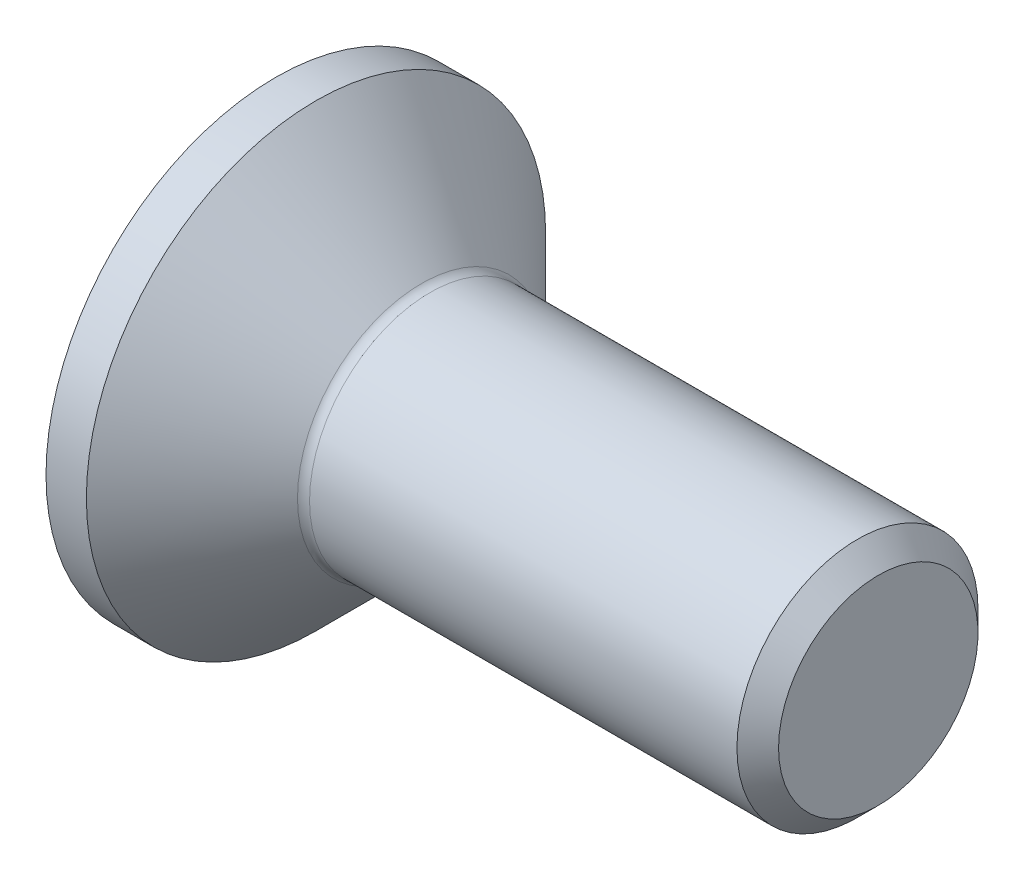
from build123d import *

# Parameters (mm, degrees)
FILLET1_R   = 0.4
HEX_2_DEPTH = 3


with BuildPart() as part:
    # BodySke → BaseBody (revolve)
    with BuildSketch(Plane.XY, mode=Mode.PRIVATE) as basebody_sk:
        Polygon((0, 0), (0, 7.62), (1.34, 7.62), (4.96, 4), (19.3095, 4), (20, 3.3095), (20, 0), align=None)
    revolve(basebody_sk.sketch.rotate(Axis((0, 0, 0), (1, 0, 0)), 90), axis=Axis((0, 0, 0), (1, 0, 0)))

    # Fillet1
    fillet1_edges = [part.edges().sort_by_distance(p)[0] for p in [
        (4.96, 0, -4),
    ]]
    fillet(fillet1_edges, radius=FILLET1_R)

    # Sketch2 → PreBroach (revolve, cut)
    with BuildSketch(Plane.XY, mode=Mode.PRIVATE) as prebroach_sk:
        Polygon((0, 2.5), (3, 2.5), (4.443375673, 0), (0, 0), align=None)
    revolve(prebroach_sk.sketch.rotate(Axis((0, 0, 0), (1, 0, 0)), 90), axis=Axis((0, 0, 0), (1, 0, 0)), mode=Mode.SUBTRACT)

    # Sketch3 → Hex 2 (cut)
    with BuildSketch(Plane.ZY):
        Polygon((-2.5, -1.443375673), (-2.5, 1.443375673), (0, 2.886751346), (2.5, 1.443375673), (2.5, -1.443375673), (0, -2.886751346), align=None)
    extrude(amount=-HEX_2_DEPTH, mode=Mode.SUBTRACT)


solid = part.part
